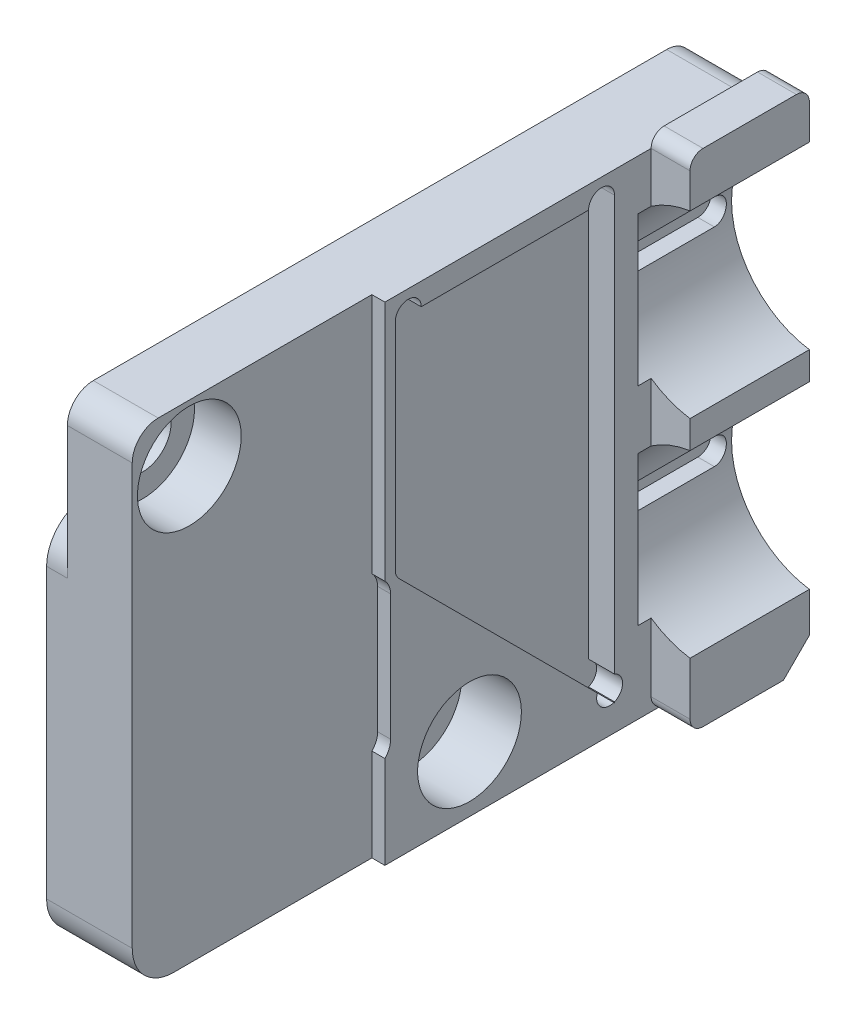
from build123d import *

# Parameters (mm, degrees)
EXTRUDE_1_DEPTH           = 2.75
HOLE_WIZARD_M2_2_D        = 2.4
FILLET_2_R                = 1.5
SKETCH_20_W               = 15.726791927
SKETCH_20_H               = 34.295525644
CUT_EXTRUDE_7_DEPTH       = 42.931909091
CUT_EXTRUDE_8_DEPTH       = 14.41324186
SKETCH_22_W               = 5.5
SKETCH_22_H               = 17.004101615
CUT_EXTRUDE_9_DEPTH       = 1.5
SKETCH_26_W               = 0.2
SKETCH_26_H               = 17.004101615
CUT_EXTRUDE_10_DEPTH      = 10
SKETCH_29_W               = 2
SKETCH_29_H               = 17.004101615
EXTRUDE_11_DEPTH          = 19.5
SKETCH_32_W               = 5.1
SKETCH_32_H               = 0.8
EXTRUDE_14_DEPTH          = 2
EXTRUDE_15_DEPTH          = 1.5
SKETCH_34_W               = 19.5
SKETCH_34_H               = 18.504101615
EXTRUDE_16_DEPTH          = 2
CUT_EXTRUDE_12_DEPTH      = 1
FILLET_4_R                = 0.5
EXTRUDE_17_DEPTH          = 0.3
CUT_EXTRUDE_13_DEPTH      = 1
SKETCH_41_R               = 0.5
CUT_EXTRUDE_15_DEPTH      = 1
FILLET_7_R                = 1
HOLE_WIZARD_0_D           = 2.2
HOLE_WIZARD_0_CBORE_D     = 4
HOLE_WIZARD_0_CBORE_DEPTH = 2.3
SKETCH_46_R               = 1.75
CUT_EXTRUDE_16_DEPTH      = 1
SKETCH_47_R               = 1
EXTRUDE_19_DEPTH          = 1.5
CHAMFER_3_SIZE            = 0.3
SKETCH_38_W               = 8.4
SKETCH_38_H               = 6.353101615
CUT_EXTRUDE_17_DEPTH      = 1
FILLET_9_R                = 0.75
CUT_EXTRUDE_START         = -1
CUT_EXTRUDE_18_DEPTH      = 1
CUT_EXTRUDE_START_2       = -0.2
SKETCH_49_R               = 1
CUT_EXTRUDE_20_DEPTH      = 0.2
CUT_EXTRUDE_START_3       = -0.5
CUT_EXTRUDE_22_DEPTH      = 0.5
CUT_EXTRUDE_21_DEPTH      = 0.5
CUT_EXTRUDE_23_DEPTH      = 3.6
SKETCH_54_W               = 4.6
SKETCH_54_H               = 0.5
CUT_EXTRUDE_24_DEPTH      = 0.5
SKETCH_55_W               = 19.6
SKETCH_55_H               = 1
CUT_EXTRUDE_25_DEPTH      = 0.8
FILLET_11_R               = 1.6
FILLET_13_R               = 0.5
SKETCH_56_R               = 0.5
CUT_EXTRUDE_26_DEPTH      = 1
SKETCH_57_W               = 10.691831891
SKETCH_57_H               = 21.561274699
CUT_EXTRUDE_27_DEPTH      = 1
SKETCH_58_R               = 2
EXTRUDE_20_DEPTH          = 0.5
FILLET_14_R               = 1
SKETCH_60_W               = 3.5
SKETCH_60_H               = 2.498992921
CUT_EXTRUDE_29_DEPTH      = 0.8
FILLET_15_R               = 1.6
FILLET_16_R               = 1
CHAMFER_4_SIZE            = 1


with BuildPart() as part:
    # Sketch 1 → Extrude 1 (new, symmetric)
    with BuildSketch(Plane.XY):
        with BuildLine():
            Line((-0.85, 33.5), (-0.85, 34.5))
            Line((-0.85, 34.5), (-4.5, 34.5))
            Line((-4.5, 34.5), (-4.5, 41))
            Line((-4.5, 41), (-7.5, 41))
            Line((-7.5, 41), (-7.5, -9.5))
            Line((-7.5, -9.5), (-4.5, -9.5))
            Line((-4.5, -9.5), (-4.5, -4.5))
            Line((-4.5, -4.5), (-0.5, -4.5))
            Line((-0.5, -4.5), (-0.5, -3.464101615))
            ThreePointArc((-0.5, -3.464101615), (-3.5, 0), (-0.5, 3.464101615))
            Line((-0.5, 3.464101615), (-0.5, 4.535898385))
            ThreePointArc((-0.5, 4.535898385), (-3.5, 8), (-0.5, 11.464101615))
            Line((-0.5, 11.464101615), (-0.5, 13.5))
            Line((-0.5, 13.5), (0.85, 14.5))
            Line((0.85, 14.5), (0.85, 15.5))
            ThreePointArc((0.85, 15.5), (-2.65, 19), (0.85, 22.5))
            Line((0.85, 22.5), (0.85, 23.5))
            Line((0.85, 23.5), (-0.85, 24.5))
            Line((-0.85, 24.5), (-0.85, 26.5))
            ThreePointArc((-0.85, 26.5), (-4.35, 30), (-0.85, 33.5))
        make_face()
    extrude(amount=EXTRUDE_1_DEPTH, both=True)

    # Hole Wizard M2 _2 (through all)
    with Locations(Plane(origin=(-4.5, 0, 8.8), x_dir=(0, 0, -1), z_dir=(1, 0, 0))):
        with Locations((8.8, -7.3), (8.8, 40.3)):
            Hole(HOLE_WIZARD_M2_2_D / 2)

    # Fillet 2
    fillet_2_edges = [part.edges().sort_by_distance(p)[0] for p in [
        (-6, 41, 2.75),
        (-6, -9.5, 2.75),
        (-6, 41, -2.75),
        (-6, -9.5, -2.75),
    ]]
    fillet(fillet_2_edges, radius=FILLET_2_R)

    # Sketch 20 → Cut-Extrude 7 (cut, through all)
    with BuildSketch(Plane(origin=(0.85, 0, 0), x_dir=(0, 0, -1), z_dir=(1, 0, 0))):
        with Locations((-0.853180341, 29.651864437)):
            Rectangle(SKETCH_20_W, SKETCH_20_H)
    extrude(amount=-CUT_EXTRUDE_7_DEPTH, mode=Mode.SUBTRACT)

    # Sketch 21 → Cut-Extrude 8 (cut, through all)
    with BuildSketch(Plane(origin=(-4.5, 0, 0), x_dir=(0, 0, -1), z_dir=(1, 0, 0))):
        with BuildLine():
            Line((-2.75, -4.5), (-2.75, -8))
            ThreePointArc((-2.75, -8), (-2.310660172, -9.060660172), (-1.25, -9.5))
            Line((-1.25, -9.5), (1.25, -9.5))
            ThreePointArc((1.25, -9.5), (2.310660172, -9.060660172), (2.75, -8))
            Line((2.75, -8), (2.75, -4.5))
            Line((2.75, -4.5), (-2.75, -4.5))
        make_face()
    extrude(amount=-CUT_EXTRUDE_8_DEPTH, mode=Mode.SUBTRACT)

    # Sketch 22 → Cut-Extrude 9 (cut)
    with BuildSketch(Plane.ZY.offset(7.5)):
        with Locations((0, 4.002050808)):
            Rectangle(SKETCH_22_W, SKETCH_22_H)
    extrude(amount=-CUT_EXTRUDE_9_DEPTH, mode=Mode.SUBTRACT)

    # Sketch 26 → Cut-Extrude 10 (cut)
    with BuildSketch(Plane(origin=(-0.5, 0, 0), x_dir=(0, 0, -1), z_dir=(1, 0, 0))):
        with Locations((2.65, 4.002050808)):
            Rectangle(SKETCH_26_W, SKETCH_26_H)
        with Locations((-2.65, 4.002050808)):
            Rectangle(SKETCH_26_W, SKETCH_26_H)
    extrude(amount=-CUT_EXTRUDE_10_DEPTH, mode=Mode.SUBTRACT)

    # Sketch 29 → Extrude 11 (add)
    with BuildSketch(Plane.XY.offset(2.55)):
        with Locations((-5, 4.002050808)):
            Rectangle(SKETCH_29_W, SKETCH_29_H)
    extrude(amount=EXTRUDE_11_DEPTH)

    # Sketch 32 → Extrude 14 (add)
    with BuildSketch(Plane(origin=(-0.5, 0, 0), x_dir=(0, 0, -1), z_dir=(1, 0, 0))):
        with Locations((0, 12.904101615)):
            Rectangle(SKETCH_32_W, SKETCH_32_H)
    extrude(amount=-EXTRUDE_14_DEPTH)

    # Sketch 33 → Extrude 15 (add)
    with BuildSketch(Plane.XZ.offset(4.5)):
        Polygon((-0.5, 2.55), (-4, 2.55), (-4, 22.05), (-6, 22.05), (-6, -2.55), (-0.5, -2.55), align=None)
    extrude(amount=EXTRUDE_15_DEPTH)

    # Sketch 34 → Extrude 16 (add)
    with BuildSketch(Plane(origin=(-4, 0, 0), x_dir=(0, 0, -1), z_dir=(1, 0, 0))):
        with Locations((-12.3, 3.252050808)):
            Rectangle(SKETCH_34_W, SKETCH_34_H)
    extrude(amount=EXTRUDE_16_DEPTH)

    # Sketch 35 → Cut-Extrude 12 (cut)
    with BuildSketch(Plane(origin=(-2, 0, 0), x_dir=(0, 0, -1), z_dir=(1, 0, 0))):
        Polygon((-12.412, 11.948992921), (-3.962, 11.948992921), (-3.962, -5.001007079), (-12.412, 3.448992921), align=None)
    extrude(amount=-CUT_EXTRUDE_12_DEPTH, mode=Mode.SUBTRACT)

    # Fillet 4
    fillet_4_edges = [part.edges().sort_by_distance(p)[0] for p in [
        (-2.5, 3.448992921, 12.412),
    ]]
    fillet(fillet_4_edges, radius=FILLET_4_R)

    # Sketch 36 → Extrude 17 (add)
    with BuildSketch(Plane(origin=(0, 12.504101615, 0), x_dir=(1, 0, 0), z_dir=(0, 1, 0))):
        Polygon((-2, -2.55), (-2.5, -2.55), (-2.5, 2.55), (-6, 2.55), (-6, -22.05), (-2, -22.05), align=None)
    extrude(amount=EXTRUDE_17_DEPTH)

    # Sketch 37 → Cut-Extrude 13 (cut)
    with BuildSketch(Plane(origin=(-2, 0, 0), x_dir=(0, 0, -1), z_dir=(1, 0, 0))):
        with BuildLine():
            Line((-21.281128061, 4.731953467), (-20.856863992, 4.307689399))
            ThreePointArc((-20.856863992, 4.307689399), (-20.326533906, 4.088019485), (-19.79620382, 4.307689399))
            Line((-19.79620382, 4.307689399), (-13.078689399, 11.02520382))
            ThreePointArc((-13.078689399, 11.02520382), (-12.859019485, 11.555533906), (-13.078689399, 12.085863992))
            Line((-13.078689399, 12.085863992), (-13.502953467, 12.510128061))
            ThreePointArc((-13.502953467, 12.510128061), (-14.033283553, 12.729797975), (-14.563613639, 12.510128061))
            Line((-14.563613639, 12.510128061), (-21.281128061, 5.792613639))
            ThreePointArc((-21.281128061, 5.792613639), (-21.500797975, 5.262283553), (-21.281128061, 4.731953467))
        make_face()
    extrude(amount=-CUT_EXTRUDE_13_DEPTH, mode=Mode.SUBTRACT)

    # Sketch 41 → Cut-Extrude 15 (cut)
    with BuildSketch(Plane(origin=(-2, 0, 0), x_dir=(0, 0, -1), z_dir=(1, 0, 0))):
        with Locations((-11.912, 11.948992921)):
            Circle(SKETCH_41_R)
        with Locations((-4.462, 11.948992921)):
            Circle(SKETCH_41_R)
    extrude(amount=-CUT_EXTRUDE_15_DEPTH, mode=Mode.SUBTRACT)

    # Fillet 7
    fillet_7_edges = [part.edges().sort_by_distance(p)[0] for p in [
        (-4, 12.804101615, 22.05),
    ]]
    fillet(fillet_7_edges, radius=FILLET_7_R)

    # Hole Wizard 0 (through all)
    with Locations(Plane(origin=(-2, 0, 0), x_dir=(0, 0, -1), z_dir=(1, 0, 0))):
        with Locations((-9.55, -3.501007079), (-19.85, 10.604101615)):
            CounterBoreHole(HOLE_WIZARD_0_D / 2, HOLE_WIZARD_0_CBORE_D / 2, HOLE_WIZARD_0_CBORE_DEPTH)

    # Sketch 46 → Cut-Extrude 16 (cut)
    with BuildSketch(Plane.ZY.offset(6)):
        with Locations(Location((9.55, -3.501007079, 0), (0, 0, 270))):
            Circle(SKETCH_46_R)
    extrude(amount=-CUT_EXTRUDE_16_DEPTH, mode=Mode.SUBTRACT)

    # Sketch 47 → Extrude 19 (add)
    with BuildSketch(Plane.ZY.offset(6)):
        with Locations(Location((-0.05, -2.195898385, 0), (0, 0, 270))):
            Circle(SKETCH_47_R)
        with Locations(Location((-0.05, 8.804101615, 0), (0, 0, 270))):
            Circle(SKETCH_47_R)
    extrude(amount=EXTRUDE_19_DEPTH)

    # Chamfer 3
    chamfer_3_edges = [part.edges().sort_by_distance(p)[0] for p in [
        (-7.5, -1.195898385, -0.05),
        (-7.5, 9.804101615, -0.05),
    ]]
    chamfer(chamfer_3_edges, length=CHAMFER_3_SIZE)

    # Sketch 38 → Cut-Extrude 17 (cut)
    with BuildSketch(Plane(origin=(-2, 0, 0), x_dir=(0, 0, -1), z_dir=(1, 0, 0))):
        with Locations((-16.791, 0.527550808)):
            Rectangle(SKETCH_38_W, SKETCH_38_H)
    extrude(amount=-CUT_EXTRUDE_17_DEPTH, mode=Mode.SUBTRACT)

    # Fillet 9
    fillet_9_edges = [part.edges().sort_by_distance(p)[0] for p in [
        (-2.5, 3.704101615, 12.591),
        (-2.5, -2.649, 12.591),
        (-2.5, -2.649, 20.991),
        (-2.5, 3.704101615, 20.991),
    ]]
    fillet(fillet_9_edges, radius=FILLET_9_R)

    # Sketch 48 → Cut-Extrude 18 (cut)
    with BuildSketch(Plane.ZY.offset(6).offset(CUT_EXTRUDE_START)):
        with BuildLine():
            Line((22.05, 8.304101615), (17.55, 8.304101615))
            Line((17.55, 8.304101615), (17.55, 12.804101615))
            Line((17.55, 12.804101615), (21.05, 12.804101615))
            ThreePointArc((21.05, 12.804101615), (21.757106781, 12.511208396), (22.05, 11.804101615))
            Line((22.05, 11.804101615), (22.05, 8.304101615))
        make_face()
    extrude(amount=CUT_EXTRUDE_18_DEPTH, mode=Mode.SUBTRACT)

    # Sketch 49 → Cut-Extrude 20 (cut)
    with BuildSketch(Plane.ZY.offset(6).offset(CUT_EXTRUDE_START_2)):
        Polygon((17.55, 12.804101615), (-2.55, 12.804101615), (-2.55, -6), (22.05, -6), (22.05, 8.304101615), (17.55, 8.304101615), align=None)
        with Locations(Location((-0.05, -2.195898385, 0), (0, 0, 270))):
            Circle(SKETCH_49_R, mode=Mode.SUBTRACT)
        with Locations(Location((-0.05, 8.804101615, 0), (0, 0, 270))):
            Circle(SKETCH_49_R, mode=Mode.SUBTRACT)
    extrude(amount=CUT_EXTRUDE_20_DEPTH, mode=Mode.SUBTRACT)

    # Sketch 52 → Cut-Extrude 22 (cut)
    with BuildSketch(Plane(origin=(0, 0, -2.55), x_dir=(-1, 0, 0), z_dir=(0, 0, -1)).offset(CUT_EXTRUDE_START_3)):
        with BuildLine():
            Line((5.8, -6), (5.8, 12.804101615))
            Line((5.8, 12.804101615), (2.5, 12.804101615))
            Line((2.5, 12.804101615), (2.5, 13.304101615))
            Line((2.5, 13.304101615), (0.5, 13.304101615))
            Line((0.5, 13.304101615), (0.5, 11.464101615))
            ThreePointArc((0.5, 11.464101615), (3.5, 8), (0.5, 4.535898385))
            Line((0.5, 4.535898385), (0.5, 3.464101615))
            ThreePointArc((0.5, 3.464101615), (3.5, 0), (0.5, -3.464101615))
            Line((0.5, -3.464101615), (0.5, -6))
            Line((0.5, -6), (5.8, -6))
        make_face()
    extrude(amount=CUT_EXTRUDE_22_DEPTH, mode=Mode.SUBTRACT)

    # Sketch 50 → Cut-Extrude 21 (cut)
    with BuildSketch(Plane(origin=(0, 0, 2.55), x_dir=(-1, 0, 0), z_dir=(0, 0, -1)).offset(CUT_EXTRUDE_START_3)):
        with BuildLine():
            Line((2, 2.872281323), (2, -2.872281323))
            ThreePointArc((2, -2.872281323), (3.5, 0), (2, 2.872281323))
        make_face()
        with BuildLine():
            Line((2, 10.872281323), (2, 5.127718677))
            ThreePointArc((2, 5.127718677), (3.5, 8), (2, 10.872281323))
        make_face()
    extrude(amount=CUT_EXTRUDE_21_DEPTH, mode=Mode.SUBTRACT)

    # Sketch 53 → Cut-Extrude 23 (cut)
    with BuildSketch(Plane(origin=(-0.5, 0, 0), x_dir=(0, 0, -1), z_dir=(1, 0, 0))):
        with BuildLine():
            Line((-2.25, 0.5), (1.35, 0.5))
            ThreePointArc((1.35, 0.5), (1.85, 0), (1.35, -0.5))
            Line((1.35, -0.5), (-2.25, -0.5))
            ThreePointArc((-2.25, -0.5), (-2.75, 0), (-2.25, 0.5))
        make_face()
        with BuildLine():
            Line((-2.25, 8.5), (1.35, 8.5))
            ThreePointArc((1.35, 8.5), (1.85, 8), (1.35, 7.5))
            Line((1.35, 7.5), (-2.25, 7.5))
            ThreePointArc((-2.25, 7.5), (-2.75, 8), (-2.25, 8.5))
        make_face()
    extrude(amount=-CUT_EXTRUDE_23_DEPTH, mode=Mode.SUBTRACT)

    # Sketch 54 → Cut-Extrude 24 (cut)
    with BuildSketch(Plane.ZY.offset(2.5)):
        with Locations((0.25, 13.054101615)):
            Rectangle(SKETCH_54_W, SKETCH_54_H)
    extrude(amount=-CUT_EXTRUDE_24_DEPTH, mode=Mode.SUBTRACT)

    # Sketch 55 → Cut-Extrude 25 (cut)
    with BuildSketch(Plane.ZY.offset(5.8)):
        with Locations((7.75, 12.304101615)):
            Rectangle(SKETCH_55_W, SKETCH_55_H)
    extrude(amount=-CUT_EXTRUDE_25_DEPTH, mode=Mode.SUBTRACT)

    # Fillet 11
    fillet_11_edges = [part.edges().sort_by_distance(p)[0] for p in [
        (-5.4, 8.304101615, 22.05),
        (-5.4, 11.804101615, 17.55),
        (-5.4, 11.804101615, -2.05),
    ]]
    fillet(fillet_11_edges, radius=FILLET_11_R)

    # Fillet 13
    fillet_13_edges = [part.edges().sort_by_distance(p)[0] for p in [
        (-1.25, 13.304101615, 2.55),
        (-1.25, -6, 2.55),
        (-1.25, 13.304101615, -2.05),
    ]]
    fillet(fillet_13_edges, radius=FILLET_13_R)

    # Sketch 56 → Cut-Extrude 26 (cut)
    with BuildSketch(Plane(origin=(-2, 0, 0), x_dir=(0, 0, -1), z_dir=(1, 0, 0))):
        with Locations((-4.15, -4.5)):
            Circle(SKETCH_56_R)
    extrude(amount=-CUT_EXTRUDE_26_DEPTH, mode=Mode.SUBTRACT)

    # Sketch 57 → Cut-Extrude 27 (cut)
    with BuildSketch(Plane(origin=(-2, 0, 0), x_dir=(0, 0, -1), z_dir=(1, 0, 0))):
        with Locations((-18.157915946, 2.023464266)):
            Rectangle(SKETCH_57_W, SKETCH_57_H)
    extrude(amount=-CUT_EXTRUDE_27_DEPTH, mode=Mode.SUBTRACT)

    # Sketch 58 → Extrude 20 (add)
    with BuildSketch(Plane(origin=(-3, 0, 0), x_dir=(0, 0, -1), z_dir=(1, 0, 0))):
        with BuildLine():
            Line((-12.812, 3.485758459), (-12.812, 12.804101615))
            Line((-12.812, 12.804101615), (-21.05, 12.804101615))
            ThreePointArc((-21.05, 12.804101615), (-21.757106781, 12.511208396), (-22.05, 11.804101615))
            Line((-22.05, 11.804101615), (-22.05, -6))
            Line((-22.05, -6), (-12.812, -6))
            Line((-12.812, -6), (-12.812, -2.430656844))
            ThreePointArc((-12.812, -2.430656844), (-12.648450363, -2.186880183), (-12.591, -1.899))
            Line((-12.591, -1.899), (-12.591, 2.954101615))
            ThreePointArc((-12.591, 2.954101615), (-12.648450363, 3.241981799), (-12.812, 3.485758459))
        make_face()
        with Locations((-19.85, 10.604101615)):
            Circle(SKETCH_58_R, mode=Mode.SUBTRACT)
    extrude(amount=EXTRUDE_20_DEPTH)

    # Fillet 14
    fillet_14_edges = [part.edges().sort_by_distance(p)[0] for p in [
        (-3.5, 12.804101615, -2.05),
    ]]
    fillet(fillet_14_edges, radius=FILLET_14_R)

    # Sketch 60 → Cut-Extrude 29 (cut)
    with BuildSketch(Plane.ZY.offset(5.8)):
        with Locations((9.55, -4.75050354)):
            Rectangle(SKETCH_60_W, SKETCH_60_H)
    extrude(amount=-CUT_EXTRUDE_29_DEPTH, mode=Mode.SUBTRACT)

    # Fillet 15
    fillet_15_edges = [part.edges().sort_by_distance(p)[0] for p in [
        (-4.15, -6, 22.05),
        (-5.4, -6, 7.8),
        (-5.4, -6, 11.3),
    ]]
    fillet(fillet_15_edges, radius=FILLET_15_R)

    # Fillet 16
    fillet_16_edges = [part.edges().sort_by_distance(p)[0] for p in [
        (-5.4, 8.304101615, 17.55),
    ]]
    fillet(fillet_16_edges, radius=FILLET_16_R)

    # Chamfer 4
    chamfer_4_edges = [part.edges().sort_by_distance(p)[0] for p in [
        (-3.15, -6, -2.05),
    ]]
    chamfer(chamfer_4_edges, length=CHAMFER_4_SIZE)


solid = part.part
